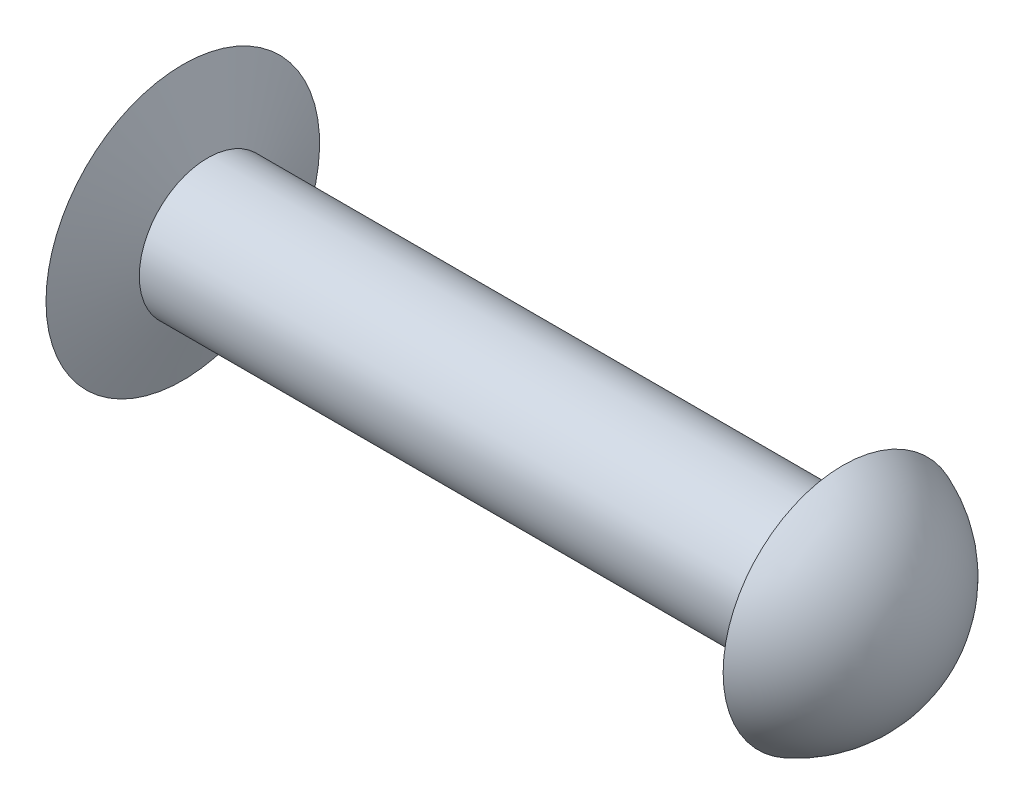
from build123d import *


with BuildPart() as part:
    # Sketch1 → Base-Revolve (revolve)
    with BuildSketch(Plane.XY, mode=Mode.PRIVATE) as base_revolve_sk:
        with BuildLine():
            Line((-30.950769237, 0), (0, 0))
            Line((0, 0), (0, 3))
            Line((0, 3), (-27.858858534, 3))
            Line((-27.858858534, 3), (-28.950769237, 6))
            ThreePointArc((-28.950769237, 6), (-30.437602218, 3.16227766), (-30.950769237, 0))
        make_face()
    revolve(base_revolve_sk.sketch.rotate(Axis((-39, 0, 0), (1, 0, 0)), 90), axis=Axis((-39, 0, 0), (1, 0, 0)))

    # Sketch2 → HeadTypeA (revolve)
    with BuildSketch(Plane.XY):
        with BuildLine():
            Line((0, 0), (3.6, 0))
            ThreePointArc((3.6, 0), (2.613552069, 3.182864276), (0, 5.25))
            Line((0, 5.25), (0, 0))
        make_face()
    revolve(axis=Axis((-49, 0, 0), (1, 0, 0)))


solid = part.part
